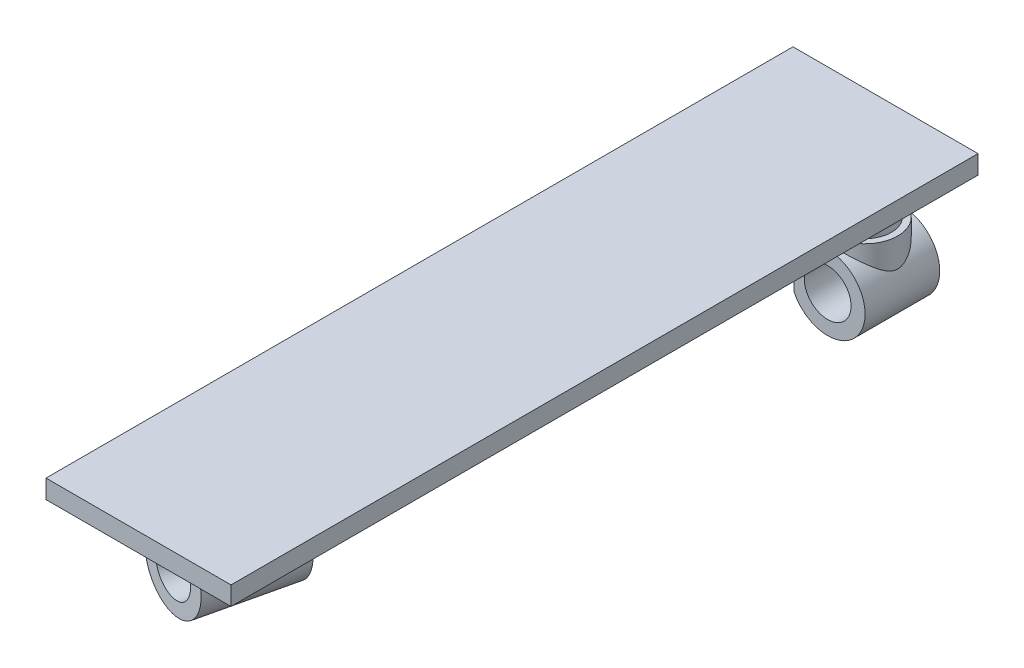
ISO-10303-21;
HEADER;
FILE_DESCRIPTION(('STEP AP214'),'2;1');
FILE_NAME('part.step','',(''),(''),'','','');
FILE_SCHEMA(('AUTOMOTIVE_DESIGN { 1 0 10303 214 1 1 1 1 }'));
ENDSEC;
DATA;
#1=APPLICATION_CONTEXT('core data for automotive mechanical design processes');
#2=APPLICATION_PROTOCOL_DEFINITION('international standard','automotive_design',2000,#1);
#3=PRODUCT_CONTEXT('',#1,'mechanical');
#4=PRODUCT('Part','Part','',(#3));
#5=PRODUCT_RELATED_PRODUCT_CATEGORY('part','',(#4));
#6=PRODUCT_DEFINITION_FORMATION('','',#4);
#7=PRODUCT_DEFINITION_CONTEXT('part definition',#1,'design');
#8=PRODUCT_DEFINITION('design','',#6,#7);
#9=PRODUCT_DEFINITION_SHAPE('','',#8);
#10=(LENGTH_UNIT() NAMED_UNIT(*) SI_UNIT(.MILLI.,.METRE.));
#11=(NAMED_UNIT(*) PLANE_ANGLE_UNIT() SI_UNIT($,.RADIAN.));
#12=(NAMED_UNIT(*) SI_UNIT($,.STERADIAN.) SOLID_ANGLE_UNIT());
#13=UNCERTAINTY_MEASURE_WITH_UNIT(LENGTH_MEASURE(1.E-05),#10,'distance_accuracy_value','');
#14=(GEOMETRIC_REPRESENTATION_CONTEXT(3) GLOBAL_UNCERTAINTY_ASSIGNED_CONTEXT((#13)) GLOBAL_UNIT_ASSIGNED_CONTEXT((#10,
#11,#12)) REPRESENTATION_CONTEXT('',''));
#15=CARTESIAN_POINT('',(0.,0.,0.));
#16=DIRECTION('',(0.,0.,1.));
#17=DIRECTION('',(1.,0.,0.));
#18=AXIS2_PLACEMENT_3D('',#15,#16,#17);
#19=CARTESIAN_POINT('',(-40.5389276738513,0.,300.));
#20=DIRECTION('',(0.,-1.,0.));
#21=DIRECTION('',(0.,0.,-1.));
#22=AXIS2_PLACEMENT_3D('',#19,#20,#21);
#23=PLANE('',#22);
#24=DIRECTION('',(-0.224951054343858,0.,0.974370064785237));
#25=VECTOR('',#24,1.);
#26=CARTESIAN_POINT('',(-20.4860149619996,0.,268.708935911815));
#27=LINE('',#26,#25);
#28=CARTESIAN_POINT('',(-26.8381368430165,0.,296.222998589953));
#29=VERTEX_POINT('',#28);
#30=CARTESIAN_POINT('',(-29.8804668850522,0.,309.400777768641));
#31=VERTEX_POINT('',#30);
#32=EDGE_CURVE('E115',#29,#31,#27,.T.);
#33=ORIENTED_EDGE('',*,*,#32,.F.);
#34=CARTESIAN_POINT('',(-40.5389276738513,0.,300.));
#35=DIRECTION('',(0.,-1.,0.));
#36=DIRECTION('',(0.,0.,-1.));
#37=AXIS2_PLACEMENT_3D('',#34,#35,#36);
#38=CIRCLE('',#37,14.2118756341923);
#39=EDGE_CURVE('E11',#31,#29,#38,.F.);
#40=ORIENTED_EDGE('',*,*,#39,.F.);
#41=EDGE_LOOP('',(#33,#40));
#42=FACE_BOUND('',#41,.T.);
#43=ADVANCED_FACE('F37',(#42),#23,.T.);
#44=CARTESIAN_POINT('',(-40.5389276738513,0.,300.));
#45=DIRECTION('',(0.,1.,0.));
#46=DIRECTION('',(0.,0.,1.));
#47=AXIS2_PLACEMENT_3D('',#44,#45,#46);
#48=CYLINDRICAL_SURFACE('',#47,17.5);
#49=CARTESIAN_POINT('',(-40.5389276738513,19.6087439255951,317.5));
#50=CARTESIAN_POINT('',(-40.0737309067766,19.5177406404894,317.499995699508));
#51=CARTESIAN_POINT('',(-39.6113945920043,19.4117596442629,317.481418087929));
#52=CARTESIAN_POINT('',(-38.6966225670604,19.1725829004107,317.408809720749));
#53=CARTESIAN_POINT('',(-38.24419031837,19.0393778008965,317.354766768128));
#54=CARTESIAN_POINT('',(-37.3520128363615,18.7486748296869,317.213303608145));
#55=CARTESIAN_POINT('',(-36.9122831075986,18.5911486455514,317.125844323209));
#56=CARTESIAN_POINT('',(-36.0482358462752,18.2550234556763,316.919843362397));
#57=CARTESIAN_POINT('',(-35.6239268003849,18.0764130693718,316.801284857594));
#58=CARTESIAN_POINT('',(-34.7969649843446,17.7033123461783,316.536818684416));
#59=CARTESIAN_POINT('',(-34.3941324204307,17.5090071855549,316.391209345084));
#60=CARTESIAN_POINT('',(-33.6065890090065,17.1059622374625,316.073980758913));
#61=CARTESIAN_POINT('',(-33.2218720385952,16.897227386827,315.902370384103));
#62=CARTESIAN_POINT('',(-32.4708873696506,16.4680407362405,315.534849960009));
#63=CARTESIAN_POINT('',(-32.1046257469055,16.24758512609,315.338931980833));
#64=CARTESIAN_POINT('',(-31.3909738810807,15.7977950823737,314.924317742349));
#65=CARTESIAN_POINT('',(-31.0435843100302,15.5684603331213,314.70562067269));
#66=CARTESIAN_POINT('',(-30.3007467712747,15.0575884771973,314.201032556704));
#67=CARTESIAN_POINT('',(-29.9094222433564,14.7747147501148,313.910415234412));
#68=CARTESIAN_POINT('',(-29.1538444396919,14.2051196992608,313.299103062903));
#69=CARTESIAN_POINT('',(-28.7895984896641,13.9183973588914,312.978400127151));
#70=CARTESIAN_POINT('',(-28.088231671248,13.3469004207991,312.307144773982));
#71=CARTESIAN_POINT('',(-27.7511065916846,13.0621255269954,311.956597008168));
#72=CARTESIAN_POINT('',(-27.1041005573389,12.5015428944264,311.224704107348));
#73=CARTESIAN_POINT('',(-26.794207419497,12.2257311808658,310.843372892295));
#74=CARTESIAN_POINT('',(-26.3220418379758,11.8004410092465,310.208681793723));
#75=CARTESIAN_POINT('',(-26.1507709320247,11.6449978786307,309.965967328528));
#76=CARTESIAN_POINT('',(-25.8184216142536,11.3433253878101,309.468171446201));
#77=CARTESIAN_POINT('',(-25.6573409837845,11.1970940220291,309.213092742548));
#78=CARTESIAN_POINT('',(-25.3460122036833,10.9171997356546,308.690100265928));
#79=CARTESIAN_POINT('',(-25.1957540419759,10.7835251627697,308.422198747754));
#80=CARTESIAN_POINT('',(-24.9067356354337,10.5326092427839,307.872791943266));
#81=CARTESIAN_POINT('',(-24.7679728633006,10.4153642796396,307.591289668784));
#82=CARTESIAN_POINT('',(-24.5308474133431,10.2243634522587,307.074907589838));
#83=CARTESIAN_POINT('',(-24.4301057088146,10.1466407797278,306.8425932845));
#84=CARTESIAN_POINT('',(-24.2373553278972,10.0070082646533,306.369762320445));
#85=CARTESIAN_POINT('',(-24.1453437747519,9.94509320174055,306.129248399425));
#86=CARTESIAN_POINT('',(-23.9711069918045,9.83965525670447,305.641299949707));
#87=CARTESIAN_POINT('',(-23.8888615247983,9.79609384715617,305.393881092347));
#88=CARTESIAN_POINT('',(-23.734869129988,9.7292443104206,304.893078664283));
#89=CARTESIAN_POINT('',(-23.6631216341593,9.70595508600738,304.639695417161));
#90=CARTESIAN_POINT('',(-23.530541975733,9.6808073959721,304.127376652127));
#91=CARTESIAN_POINT('',(-23.4697785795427,9.67907962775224,303.868416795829));
#92=CARTESIAN_POINT('',(-23.3602672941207,9.69748949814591,303.348753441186));
#93=CARTESIAN_POINT('',(-23.3115194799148,9.71762727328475,303.088049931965));
#94=CARTESIAN_POINT('',(-23.2261574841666,9.77872582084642,302.566689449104));
#95=CARTESIAN_POINT('',(-23.1895633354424,9.81972069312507,302.306033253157));
#96=CARTESIAN_POINT('',(-23.1284411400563,9.92053623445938,301.786981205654));
#97=CARTESIAN_POINT('',(-23.1039151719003,9.98036014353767,301.528585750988));
#98=CARTESIAN_POINT('',(-23.0597412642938,10.1409523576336,300.922408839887));
#99=CARTESIAN_POINT('',(-23.0450697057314,10.2487033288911,300.576115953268));
#100=CARTESIAN_POINT('',(-23.0359109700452,10.487971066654,299.891605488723));
#101=CARTESIAN_POINT('',(-23.041433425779,10.6194991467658,299.553391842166));
#102=CARTESIAN_POINT('',(-23.0713060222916,10.9009151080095,298.884343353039));
#103=CARTESIAN_POINT('',(-23.0957178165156,11.050861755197,298.553536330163));
#104=CARTESIAN_POINT('',(-23.1622640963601,11.3639423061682,297.900139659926));
#105=CARTESIAN_POINT('',(-23.204398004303,11.5270757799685,297.577549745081));
#106=CARTESIAN_POINT('',(-23.2983258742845,11.8388648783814,296.985319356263));
#107=CARTESIAN_POINT('',(-23.347897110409,11.9862848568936,296.714667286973));
#108=CARTESIAN_POINT('',(-23.4590561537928,12.2861107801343,296.178626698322));
#109=CARTESIAN_POINT('',(-23.5206455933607,12.4385173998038,295.913238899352));
#110=CARTESIAN_POINT('',(-23.7230874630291,12.9008774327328,295.124270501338));
#111=CARTESIAN_POINT('',(-23.8815837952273,13.2158716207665,294.608068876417));
#112=CARTESIAN_POINT('',(-24.2445699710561,13.8489776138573,293.594246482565));
#113=CARTESIAN_POINT('',(-24.4490598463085,14.1670894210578,293.096625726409));
#114=CARTESIAN_POINT('',(-24.9041583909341,14.7986183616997,292.120025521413));
#115=CARTESIAN_POINT('',(-25.1547495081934,15.1120372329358,291.641039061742));
#116=CARTESIAN_POINT('',(-25.6640551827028,15.6839377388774,290.76931116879));
#117=CARTESIAN_POINT('',(-25.9166104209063,15.9439208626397,290.373951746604));
#118=CARTESIAN_POINT('',(-26.4569419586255,16.4514277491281,289.59949110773));
#119=CARTESIAN_POINT('',(-26.7447197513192,16.698950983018,289.220390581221));
#120=CARTESIAN_POINT('',(-27.3554799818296,17.1769566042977,288.481490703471));
#121=CARTESIAN_POINT('',(-27.6784016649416,17.4074672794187,288.121659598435));
#122=CARTESIAN_POINT('',(-28.3600237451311,17.8475900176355,287.423750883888));
#123=CARTESIAN_POINT('',(-28.7187145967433,18.0572076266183,287.085667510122));
#124=CARTESIAN_POINT('',(-29.3890869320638,18.4079974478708,286.506219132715));
#125=CARTESIAN_POINT('',(-29.693891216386,18.5541122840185,286.259873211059));
#126=CARTESIAN_POINT('',(-30.3244639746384,18.8286856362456,285.784850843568));
#127=CARTESIAN_POINT('',(-30.6502277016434,18.9571481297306,285.556170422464));
#128=CARTESIAN_POINT('',(-31.3216342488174,19.1942512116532,285.118737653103));
#129=CARTESIAN_POINT('',(-31.6672709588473,19.3028978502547,284.909979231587));
#130=CARTESIAN_POINT('',(-32.3769552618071,19.4983820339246,284.514614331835));
#131=CARTESIAN_POINT('',(-32.7410030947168,19.5852192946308,284.328008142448));
#132=CARTESIAN_POINT('',(-33.4878815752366,19.7357933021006,283.978016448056));
#133=CARTESIAN_POINT('',(-33.8708232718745,19.7993686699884,283.814797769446));
#134=CARTESIAN_POINT('',(-34.6503649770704,19.9011360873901,283.515183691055));
#135=CARTESIAN_POINT('',(-35.0469650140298,19.939328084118,283.378788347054));
#136=CARTESIAN_POINT('',(-35.8503361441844,19.9894001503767,283.134552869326));
#137=CARTESIAN_POINT('',(-36.2571034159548,20.0012899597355,283.026702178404));
#138=CARTESIAN_POINT('',(-37.077249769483,19.9984884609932,282.840642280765));
#139=CARTESIAN_POINT('',(-37.4906282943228,19.983799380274,282.762430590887));
#140=CARTESIAN_POINT('',(-38.2757315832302,19.9311964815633,282.64291640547));
#141=CARTESIAN_POINT('',(-38.6471767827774,19.8959379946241,282.598558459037));
#142=CARTESIAN_POINT('',(-39.3896475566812,19.805214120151,282.533804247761));
#143=CARTESIAN_POINT('',(-39.7606731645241,19.7497504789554,282.513405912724));
#144=CARTESIAN_POINT('',(-40.4999007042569,19.6196174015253,282.496137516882));
#145=CARTESIAN_POINT('',(-40.8681023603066,19.5449461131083,282.499269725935));
#146=CARTESIAN_POINT('',(-41.5994856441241,19.3776645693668,282.528331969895));
#147=CARTESIAN_POINT('',(-41.9626669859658,19.2850532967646,282.554263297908));
#148=CARTESIAN_POINT('',(-42.6958880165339,19.0794790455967,282.629378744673));
#149=CARTESIAN_POINT('',(-43.0656596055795,18.9658736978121,282.679413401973));
#150=CARTESIAN_POINT('',(-43.7960713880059,18.7226120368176,282.801797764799));
#151=CARTESIAN_POINT('',(-44.1567116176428,18.5929557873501,282.874147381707));
#152=CARTESIAN_POINT('',(-44.8675988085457,18.3193400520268,283.039875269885));
#153=CARTESIAN_POINT('',(-45.217844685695,18.1753790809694,283.13325572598));
#154=CARTESIAN_POINT('',(-45.9069738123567,17.8749040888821,283.339762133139));
#155=CARTESIAN_POINT('',(-46.2458546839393,17.7183874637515,283.452892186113));
#156=CARTESIAN_POINT('',(-47.0767665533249,17.3141173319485,283.758440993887));
#157=CARTESIAN_POINT('',(-47.5613439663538,17.0596319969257,283.962346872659));
#158=CARTESIAN_POINT('',(-48.5020864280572,16.5318670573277,284.408038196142));
#159=CARTESIAN_POINT('',(-48.9582391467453,16.2585794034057,284.649839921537));
#160=CARTESIAN_POINT('',(-49.8428796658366,15.6976579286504,285.16927316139));
#161=CARTESIAN_POINT('',(-50.2712708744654,15.4099796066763,285.447020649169));
#162=CARTESIAN_POINT('',(-51.0985354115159,14.8265540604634,286.035673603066));
#163=CARTESIAN_POINT('',(-51.4974141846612,14.5308083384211,286.346572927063));
#164=CARTESIAN_POINT('',(-52.2741982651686,13.9305235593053,287.007723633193));
#165=CARTESIAN_POINT('',(-52.6514603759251,13.6259329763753,287.358682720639));
#166=CARTESIAN_POINT('',(-53.3757164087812,13.0212710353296,288.09480306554));
#167=CARTESIAN_POINT('',(-53.7226947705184,12.7212020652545,288.479981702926));
#168=CARTESIAN_POINT('',(-54.21939815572,12.2822952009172,289.083853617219));
#169=CARTESIAN_POINT('',(-54.3807756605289,12.1380718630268,289.289159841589));
#170=CARTESIAN_POINT('',(-54.6957238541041,11.8547004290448,289.709032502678));
#171=CARTESIAN_POINT('',(-54.8492957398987,11.7155515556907,289.923597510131));
#172=CARTESIAN_POINT('',(-55.1483019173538,11.4442331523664,290.362232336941));
#173=CARTESIAN_POINT('',(-55.2937437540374,11.3120571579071,290.586292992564));
#174=CARTESIAN_POINT('',(-55.576290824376,11.0567460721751,291.044546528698));
#175=CARTESIAN_POINT('',(-55.713398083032,10.9336087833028,291.27873692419));
#176=CARTESIAN_POINT('',(-55.9700796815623,10.7066927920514,291.741975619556));
#177=CARTESIAN_POINT('',(-56.0902140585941,10.6021734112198,291.970348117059));
#178=CARTESIAN_POINT('',(-56.3222206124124,10.4058219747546,292.436572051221));
#179=CARTESIAN_POINT('',(-56.4340936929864,10.3139885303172,292.6744224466));
#180=CARTESIAN_POINT('',(-56.6485949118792,10.1460167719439,293.159044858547));
#181=CARTESIAN_POINT('',(-56.7512422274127,10.0698454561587,293.405796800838));
#182=CARTESIAN_POINT('',(-56.9465767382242,9.93594032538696,293.908070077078));
#183=CARTESIAN_POINT('',(-57.0392669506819,9.87820091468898,294.163588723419));
#184=CARTESIAN_POINT('',(-57.2148636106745,9.78322623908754,294.685860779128));
#185=CARTESIAN_POINT('',(-57.297615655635,9.74628803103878,294.952721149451));
#186=CARTESIAN_POINT('',(-57.4507046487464,9.69628533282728,295.492186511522));
#187=CARTESIAN_POINT('',(-57.5210430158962,9.6832181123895,295.76479084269));
#188=CARTESIAN_POINT('',(-57.6484665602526,9.68176334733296,296.313144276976));
#189=CARTESIAN_POINT('',(-57.7055519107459,9.69337548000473,296.588893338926));
#190=CARTESIAN_POINT('',(-57.8060597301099,9.7405534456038,297.14082536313));
#191=CARTESIAN_POINT('',(-57.8494802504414,9.77612269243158,297.417008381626));
#192=CARTESIAN_POINT('',(-57.9263781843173,9.87384840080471,297.99503365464));
#193=CARTESIAN_POINT('',(-57.9584221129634,9.93831308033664,298.296672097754));
#194=CARTESIAN_POINT('',(-58.0066174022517,10.0899706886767,298.895413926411));
#195=CARTESIAN_POINT('',(-58.0227655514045,10.177168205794,299.192516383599));
#196=CARTESIAN_POINT('',(-58.0400598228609,10.370457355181,299.781874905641));
#197=CARTESIAN_POINT('',(-58.0411596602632,10.4766062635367,300.074113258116));
#198=CARTESIAN_POINT('',(-58.0291521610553,10.7037965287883,300.652515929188));
#199=CARTESIAN_POINT('',(-58.0160387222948,10.8248442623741,300.938677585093));
#200=CARTESIAN_POINT('',(-57.9790619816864,11.0615169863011,301.467026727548));
#201=CARTESIAN_POINT('',(-57.9568684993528,11.1757066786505,301.709982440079));
#202=CARTESIAN_POINT('',(-57.9028678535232,11.410898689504,302.191396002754));
#203=CARTESIAN_POINT('',(-57.8710626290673,11.5318996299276,302.429854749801));
#204=CARTESIAN_POINT('',(-57.7617123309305,11.9029770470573,303.139263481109));
#205=CARTESIAN_POINT('',(-57.6702529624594,12.1609997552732,303.603968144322));
#206=CARTESIAN_POINT('',(-57.4519898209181,12.6888676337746,304.518819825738));
#207=CARTESIAN_POINT('',(-57.3251350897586,12.9587293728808,304.968944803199));
#208=CARTESIAN_POINT('',(-57.036973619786,13.5029614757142,305.855032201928));
#209=CARTESIAN_POINT('',(-56.875675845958,13.7773306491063,306.290998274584));
#210=CARTESIAN_POINT('',(-56.5041729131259,14.3475144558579,307.184262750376));
#211=CARTESIAN_POINT('',(-56.2910515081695,14.6432527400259,307.640400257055));
#212=CARTESIAN_POINT('',(-55.8241765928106,15.2278546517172,308.536172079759));
#213=CARTESIAN_POINT('',(-55.5704160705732,15.51671708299,308.975803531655));
#214=CARTESIAN_POINT('',(-55.0220525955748,16.0816335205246,309.836096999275));
#215=CARTESIAN_POINT('',(-54.7275245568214,16.3577098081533,310.256791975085));
#216=CARTESIAN_POINT('',(-54.0965619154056,16.8922880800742,311.077374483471));
#217=CARTESIAN_POINT('',(-53.7601403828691,17.1507955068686,311.477268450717));
#218=CARTESIAN_POINT('',(-53.1279586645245,17.5874947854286,312.162661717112));
#219=CARTESIAN_POINT('',(-52.840874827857,17.7704051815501,312.453175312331));
#220=CARTESIAN_POINT('',(-52.2418227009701,18.1200987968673,313.017740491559));
#221=CARTESIAN_POINT('',(-51.9298602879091,18.2868858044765,313.291795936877));
#222=CARTESIAN_POINT('',(-51.2814729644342,18.6017043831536,313.821100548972));
#223=CARTESIAN_POINT('',(-50.9450509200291,18.7497381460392,314.076351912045));
#224=CARTESIAN_POINT('',(-50.2486475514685,19.024409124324,314.565450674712));
#225=CARTESIAN_POINT('',(-49.8886660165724,19.1510461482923,314.7992978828));
#226=CARTESIAN_POINT('',(-49.1431810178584,19.3814353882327,315.244906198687));
#227=CARTESIAN_POINT('',(-48.7574660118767,19.4849566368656,315.456434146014));
#228=CARTESIAN_POINT('',(-47.9660585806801,19.6651401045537,315.851919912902));
#229=CARTESIAN_POINT('',(-47.5603656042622,19.7418015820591,316.0358769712));
#230=CARTESIAN_POINT('',(-46.7327428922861,19.8662270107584,316.373335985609));
#231=CARTESIAN_POINT('',(-46.3108322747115,19.9140239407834,316.526872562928));
#232=CARTESIAN_POINT('',(-45.4543533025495,19.9795345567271,316.80150832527));
#233=CARTESIAN_POINT('',(-45.0197881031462,19.9972556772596,316.922615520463));
#234=CARTESIAN_POINT('',(-44.2484173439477,20.0015648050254,317.10575361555));
#235=CARTESIAN_POINT('',(-43.9133229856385,19.9946329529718,317.174988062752));
#236=CARTESIAN_POINT('',(-43.2403466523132,19.9633162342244,317.29361331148));
#237=CARTESIAN_POINT('',(-42.9024640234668,19.9389271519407,317.342999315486));
#238=CARTESIAN_POINT('',(-42.2260391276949,19.8730760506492,317.421814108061));
#239=CARTESIAN_POINT('',(-41.8874968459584,19.8316136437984,317.451242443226));
#240=CARTESIAN_POINT('',(-41.2117826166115,19.7322797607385,317.490335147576));
#241=CARTESIAN_POINT('',(-40.8746104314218,19.6744112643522,317.500003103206));
#242=CARTESIAN_POINT('',(-40.5389276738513,19.6087439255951,317.5));
#243=B_SPLINE_CURVE_WITH_KNOTS('',3,(#49,#50,#51,#52,#53,#54,#55,#56,#57,#58,#59,#60,#61,#62,
#63,#64,#65,#66,#67,#68,#69,#70,#71,#72,#73,#74,#75,#76,#77,#78,#79,#80,#81,#82,#83,#84,#85,#86,
#87,#88,#89,#90,#91,#92,#93,#94,#95,#96,#97,#98,#99,#100,#101,#102,#103,#104,#105,#106,#107,
#108,#109,#110,#111,#112,#113,#114,#115,#116,#117,#118,#119,#120,#121,#122,#123,#124,#125,#126,
#127,#128,#129,#130,#131,#132,#133,#134,#135,#136,#137,#138,#139,#140,#141,#142,#143,#144,#145,
#146,#147,#148,#149,#150,#151,#152,#153,#154,#155,#156,#157,#158,#159,#160,#161,#162,#163,#164,
#165,#166,#167,#168,#169,#170,#171,#172,#173,#174,#175,#176,#177,#178,#179,#180,#181,#182,#183,
#184,#185,#186,#187,#188,#189,#190,#191,#192,#193,#194,#195,#196,#197,#198,#199,#200,#201,#202,
#203,#204,#205,#206,#207,#208,#209,#210,#211,#212,#213,#214,#215,#216,#217,#218,#219,#220,#221,
#222,#223,#224,#225,#226,#227,#228,#229,#230,#231,#232,#233,#234,#235,#236,#237,#238,#239,#240,
#241,#242),.UNSPECIFIED.,.T.,.F.,(4,2,2,2,2,2,2,2,2,2,2,2,2,2,2,2,2,2,2,2,2,2,2,2,2,2,2,2,2,2,2,
2,2,2,2,2,2,2,2,2,2,2,2,2,2,2,2,2,2,2,2,2,2,2,2,2,2,2,2,2,2,2,2,2,2,2,2,2,2,2,2,2,2,2,2,2,2,2,2,
2,2,2,2,2,2,2,2,2,2,2,2,2,2,2,2,2,4),(0.,1.42161879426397,2.84372675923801,4.2675028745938,
5.69205104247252,7.10173258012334,8.51093418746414,9.92059673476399,11.3303094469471,
13.0194590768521,14.7090640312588,16.3984061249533,18.0869885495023,19.0923868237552,
20.0975654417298,21.1018018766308,22.1058169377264,22.8998051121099,23.6935307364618,
24.4855817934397,25.277589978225,26.0743967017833,26.8712084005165,27.6693270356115,
28.4675830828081,29.5546862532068,30.6423080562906,31.7334948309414,32.8246460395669,
33.7607826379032,34.6970464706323,36.5702056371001,38.4433660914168,40.3158148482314,
41.9234909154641,43.5312351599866,45.1362429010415,46.7408234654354,47.9944519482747,
49.2477975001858,50.5007597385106,51.7537383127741,53.0152515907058,54.2767674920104,
55.5378161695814,56.7987591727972,57.9246804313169,59.0505043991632,60.1764369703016,
61.3024334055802,62.4714493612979,63.6404606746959,64.8095934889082,65.978969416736,
67.7286491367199,69.4790826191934,71.2353113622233,72.9912152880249,74.7852335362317,
76.5801682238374,77.4748928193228,78.3694797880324,79.263222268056,80.1567467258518,
80.9914705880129,81.8261029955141,82.6589582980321,83.4915605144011,84.3357695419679,
85.1798820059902,86.0239834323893,86.8682051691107,87.7970741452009,88.7261307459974,
89.658044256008,90.5903580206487,91.3981423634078,92.2057638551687,93.8219237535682,
95.4404225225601,97.0585005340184,98.8085717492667,100.558945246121,102.306143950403,
104.052798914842,105.394196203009,106.735277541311,108.076201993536,109.417138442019,
110.770926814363,112.124752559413,113.477028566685,114.828970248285,115.854715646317,
116.880708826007,117.906725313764,118.932555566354),.UNSPECIFIED.);
#244=CARTESIAN_POINT('',(-40.5389276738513,19.6087439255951,317.5));
#245=VERTEX_POINT('',#244);
#246=EDGE_CURVE('E41',#245,#245,#243,.T.);
#247=ORIENTED_EDGE('',*,*,#246,.T.);
#248=EDGE_LOOP('',(#247));
#249=FACE_BOUND('',#248,.T.);
#250=CARTESIAN_POINT('',(-40.5389276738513,25.,300.));
#251=DIRECTION('',(0.,-1.,0.));
#252=DIRECTION('',(0.,0.,-1.));
#253=AXIS2_PLACEMENT_3D('',#250,#251,#252);
#254=CIRCLE('',#253,17.5);
#255=CARTESIAN_POINT('',(-40.5389276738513,25.,282.5));
#256=VERTEX_POINT('',#255);
#257=EDGE_CURVE('E133',#256,#256,#254,.T.);
#258=ORIENTED_EDGE('',*,*,#257,.T.);
#259=EDGE_LOOP('',(#258));
#260=FACE_BOUND('',#259,.T.);
#261=ADVANCED_FACE('F225',(#249,#260),#48,.T.);
#262=CARTESIAN_POINT('',(30.7914319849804,45.,370.31319337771));
#263=DIRECTION('',(0.,-1.,0.));
#264=DIRECTION('',(0.,0.,-1.));
#265=AXIS2_PLACEMENT_3D('',#262,#263,#264);
#266=PLANE('',#265);
#267=DIRECTION('',(0.,0.,-1.));
#268=VECTOR('',#267,1.);
#269=CARTESIAN_POINT('',(30.7914319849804,45.,-29.6868066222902));
#270=LINE('',#269,#268);
#271=CARTESIAN_POINT('',(30.7914319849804,45.,370.31319337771));
#272=VERTEX_POINT('',#271);
#273=CARTESIAN_POINT('',(30.7914319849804,45.,-29.6868066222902));
#274=VERTEX_POINT('',#273);
#275=EDGE_CURVE('E143',#272,#274,#270,.T.);
#276=ORIENTED_EDGE('',*,*,#275,.F.);
#277=DIRECTION('',(1.,0.,0.));
#278=VECTOR('',#277,1.);
#279=CARTESIAN_POINT('',(30.7914319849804,45.,370.31319337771));
#280=LINE('',#279,#278);
#281=CARTESIAN_POINT('',(-68.2784755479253,45.,370.31319337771));
#282=VERTEX_POINT('',#281);
#283=EDGE_CURVE('E153',#282,#272,#280,.T.);
#284=ORIENTED_EDGE('',*,*,#283,.F.);
#285=DIRECTION('',(0.,0.,1.));
#286=VECTOR('',#285,1.);
#287=CARTESIAN_POINT('',(-68.2784755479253,45.,-29.6868066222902));
#288=LINE('',#287,#286);
#289=CARTESIAN_POINT('',(-68.2784755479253,45.,-29.6868066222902));
#290=VERTEX_POINT('',#289);
#291=EDGE_CURVE('E150',#290,#282,#288,.T.);
#292=ORIENTED_EDGE('',*,*,#291,.F.);
#293=DIRECTION('',(-1.,0.,0.));
#294=VECTOR('',#293,1.);
#295=CARTESIAN_POINT('',(30.7914319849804,45.,-29.6868066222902));
#296=LINE('',#295,#294);
#297=EDGE_CURVE('E146',#274,#290,#296,.T.);
#298=ORIENTED_EDGE('',*,*,#297,.F.);
#299=EDGE_LOOP('',(#276,#284,#292,#298));
#300=FACE_BOUND('',#299,.T.);
#301=CARTESIAN_POINT('',(0.,45.,0.));
#302=DIRECTION('',(0.,-1.,0.));
#303=DIRECTION('',(0.,0.,-1.));
#304=AXIS2_PLACEMENT_3D('',#301,#302,#303);
#305=CIRCLE('',#304,14.142135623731);
#306=CARTESIAN_POINT('',(0.,45.,-14.142135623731));
#307=VERTEX_POINT('',#306);
#308=EDGE_CURVE('E119',#307,#307,#305,.F.);
#309=ORIENTED_EDGE('',*,*,#308,.T.);
#310=EDGE_LOOP('',(#309));
#311=FACE_BOUND('',#310,.T.);
#312=CARTESIAN_POINT('',(-40.5389276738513,45.,300.));
#313=DIRECTION('',(0.,-1.,0.));
#314=DIRECTION('',(0.,0.,-1.));
#315=AXIS2_PLACEMENT_3D('',#312,#313,#314);
#316=CIRCLE('',#315,12.5);
#317=CARTESIAN_POINT('',(-40.5389276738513,45.,287.5));
#318=VERTEX_POINT('',#317);
#319=EDGE_CURVE('E136',#318,#318,#316,.T.);
#320=ORIENTED_EDGE('',*,*,#319,.F.);
#321=EDGE_LOOP('',(#320));
#322=FACE_BOUND('',#321,.T.);
#323=ADVANCED_FACE('F221',(#300,#311,#322),#266,.T.);
#324=CARTESIAN_POINT('',(0.,0.,20.));
#325=DIRECTION('',(0.,0.,1.));
#326=DIRECTION('',(1.,0.,0.));
#327=AXIS2_PLACEMENT_3D('',#324,#325,#326);
#328=PLANE('',#327);
#329=DIRECTION('',(0.,1.,0.));
#330=VECTOR('',#329,1.);
#331=CARTESIAN_POINT('',(-18.,10.,20.));
#332=LINE('',#331,#330);
#333=CARTESIAN_POINT('',(-18.,-8.71779788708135,20.));
#334=VERTEX_POINT('',#333);
#335=CARTESIAN_POINT('',(-18.,8.71779788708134,20.));
#336=VERTEX_POINT('',#335);
#337=EDGE_CURVE('E57',#334,#336,#332,.T.);
#338=ORIENTED_EDGE('',*,*,#337,.F.);
#339=CARTESIAN_POINT('',(0.,0.,20.));
#340=DIRECTION('',(0.,0.,1.));
#341=DIRECTION('',(1.,0.,0.));
#342=AXIS2_PLACEMENT_3D('',#339,#340,#341);
#343=CIRCLE('',#342,20.);
#344=EDGE_CURVE('E478',#334,#336,#343,.T.);
#345=ORIENTED_EDGE('',*,*,#344,.T.);
#346=EDGE_LOOP('',(#338,#345));
#347=FACE_BOUND('',#346,.T.);
#348=CARTESIAN_POINT('',(0.,0.,20.));
#349=DIRECTION('',(0.,0.,1.));
#350=DIRECTION('',(1.,0.,0.));
#351=AXIS2_PLACEMENT_3D('',#348,#349,#350);
#352=CIRCLE('',#351,12.5);
#353=CARTESIAN_POINT('',(12.5,0.,20.));
#354=VERTEX_POINT('',#353);
#355=EDGE_CURVE('E188',#354,#354,#352,.T.);
#356=ORIENTED_EDGE('',*,*,#355,.F.);
#357=EDGE_LOOP('',(#356));
#358=FACE_BOUND('',#357,.T.);
#359=ADVANCED_FACE('F224',(#347,#358),#328,.T.);
#360=CARTESIAN_POINT('',(0.,0.,-20.));
#361=DIRECTION('',(0.,0.,1.));
#362=DIRECTION('',(1.,0.,0.));
#363=AXIS2_PLACEMENT_3D('',#360,#361,#362);
#364=PLANE('',#363);
#365=CARTESIAN_POINT('',(0.,0.,-20.));
#366=DIRECTION('',(0.,0.,1.));
#367=DIRECTION('',(1.,0.,0.));
#368=AXIS2_PLACEMENT_3D('',#365,#366,#367);
#369=CIRCLE('',#368,20.);
#370=CARTESIAN_POINT('',(-18.,-8.71779788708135,-20.));
#371=VERTEX_POINT('',#370);
#372=CARTESIAN_POINT('',(-18.,8.71779788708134,-20.));
#373=VERTEX_POINT('',#372);
#374=EDGE_CURVE('E479',#371,#373,#369,.T.);
#375=ORIENTED_EDGE('',*,*,#374,.F.);
#376=DIRECTION('',(0.,1.,0.));
#377=VECTOR('',#376,1.);
#378=CARTESIAN_POINT('',(-18.,10.,-20.));
#379=LINE('',#378,#377);
#380=EDGE_CURVE('E174',#371,#373,#379,.T.);
#381=ORIENTED_EDGE('',*,*,#380,.T.);
#382=EDGE_LOOP('',(#375,#381));
#383=FACE_BOUND('',#382,.T.);
#384=CARTESIAN_POINT('',(0.,0.,-20.));
#385=DIRECTION('',(0.,0.,1.));
#386=DIRECTION('',(1.,0.,0.));
#387=AXIS2_PLACEMENT_3D('',#384,#385,#386);
#388=CIRCLE('',#387,12.5);
#389=CARTESIAN_POINT('',(12.5,0.,-20.));
#390=VERTEX_POINT('',#389);
#391=EDGE_CURVE('E187',#390,#390,#388,.T.);
#392=ORIENTED_EDGE('',*,*,#391,.T.);
#393=EDGE_LOOP('',(#392));
#394=FACE_BOUND('',#393,.T.);
#395=ADVANCED_FACE('F302',(#383,#394),#364,.F.);
#396=CARTESIAN_POINT('',(0.,0.,20.));
#397=DIRECTION('',(0.,0.,-1.));
#398=DIRECTION('',(-1.,0.,0.));
#399=AXIS2_PLACEMENT_3D('',#396,#397,#398);
#400=CYLINDRICAL_SURFACE('',#399,20.);
#401=CARTESIAN_POINT('',(0.,20.,17.5));
#402=CARTESIAN_POINT('',(0.409310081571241,20.0000043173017,17.5000043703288));
#403=CARTESIAN_POINT('',(0.81857181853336,19.9874130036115,17.4856188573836));
#404=CARTESIAN_POINT('',(1.63371360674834,19.9373449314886,17.428365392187));
#405=CARTESIAN_POINT('',(2.03959248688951,19.8998598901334,17.3854879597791));
#406=CARTESIAN_POINT('',(2.84495519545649,19.8007848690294,17.271995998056));
#407=CARTESIAN_POINT('',(3.24443051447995,19.739165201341,17.2013473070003));
#408=CARTESIAN_POINT('',(4.03348452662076,19.5931618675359,17.0336049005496));
#409=CARTESIAN_POINT('',(4.42306380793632,19.5087795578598,16.9365127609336));
#410=CARTESIAN_POINT('',(5.18734779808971,19.3195605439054,16.7182045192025));
#411=CARTESIAN_POINT('',(5.5621332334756,19.2148614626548,16.5971506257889));
#412=CARTESIAN_POINT('',(6.29757814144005,18.9865422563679,16.3322776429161));
#413=CARTESIAN_POINT('',(6.6582377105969,18.8629222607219,16.188458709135));
#414=CARTESIAN_POINT('',(7.36399894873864,18.5987498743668,15.8798571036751));
#415=CARTESIAN_POINT('',(7.70910095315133,18.4581978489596,15.715074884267));
#416=CARTESIAN_POINT('',(8.38281370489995,18.1621555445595,15.3662745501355));
#417=CARTESIAN_POINT('',(8.71142079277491,18.0066619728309,15.1822521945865));
#418=CARTESIAN_POINT('',(9.47545139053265,17.6199703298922,14.721904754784));
#419=CARTESIAN_POINT('',(9.90295999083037,17.3827741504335,14.4374321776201));
#420=CARTESIAN_POINT('',(10.7241338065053,16.8885404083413,13.8384055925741));
#421=CARTESIAN_POINT('',(11.1177867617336,16.6314957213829,13.5238407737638));
#422=CARTESIAN_POINT('',(11.8718925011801,16.101891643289,12.8669653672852));
#423=CARTESIAN_POINT('',(12.2322661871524,15.8292976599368,12.5245921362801));
#424=CARTESIAN_POINT('',(12.9189520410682,15.2740176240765,11.8150097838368));
#425=CARTESIAN_POINT('',(13.245268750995,14.9913329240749,11.4478039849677));
#426=CARTESIAN_POINT('',(13.8709259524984,14.4146539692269,10.6816356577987));
#427=CARTESIAN_POINT('',(14.1695316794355,14.1205473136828,10.2821585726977));
#428=CARTESIAN_POINT('',(14.7319137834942,13.532778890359,9.45882545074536));
#429=CARTESIAN_POINT('',(14.9956791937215,13.2391172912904,9.03496179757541));
#430=CARTESIAN_POINT('',(15.4875688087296,12.6601412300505,8.16304947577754));
#431=CARTESIAN_POINT('',(15.7157616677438,12.3748115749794,7.7150496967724));
#432=CARTESIAN_POINT('',(16.1360267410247,11.8215430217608,6.79231309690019));
#433=CARTESIAN_POINT('',(16.3281264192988,11.5535910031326,6.31759696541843));
#434=CARTESIAN_POINT('',(16.5900333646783,11.171205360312,5.5760316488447));
#435=CARTESIAN_POINT('',(16.6739706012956,11.0453363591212,5.32001317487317));
#436=CARTESIAN_POINT('',(16.8311299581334,10.8043372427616,4.79968230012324));
#437=CARTESIAN_POINT('',(16.9043516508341,10.6892075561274,4.53536956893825));
#438=CARTESIAN_POINT('',(17.03927411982,10.4727930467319,3.99869568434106));
#439=CARTESIAN_POINT('',(17.1009917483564,10.37148803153,3.72634699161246));
#440=CARTESIAN_POINT('',(17.2121601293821,10.1859341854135,3.17347969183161));
#441=CARTESIAN_POINT('',(17.2616155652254,10.1016788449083,2.89296424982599));
#442=CARTESIAN_POINT('',(17.3407113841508,9.96518782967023,2.36830260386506));
#443=CARTESIAN_POINT('',(17.3722302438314,9.91001953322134,2.1252065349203));
#444=CARTESIAN_POINT('',(17.425218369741,9.81655062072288,1.63478947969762));
#445=CARTESIAN_POINT('',(17.4466926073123,9.77824166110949,1.3874706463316));
#446=CARTESIAN_POINT('',(17.4791148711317,9.7201678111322,0.890241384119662));
#447=CARTESIAN_POINT('',(17.4900749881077,9.70038162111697,0.64033426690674));
#448=CARTESIAN_POINT('',(17.5012364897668,9.68023037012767,0.139486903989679));
#449=CARTESIAN_POINT('',(17.5014379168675,9.67986523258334,-0.11145333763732));
#450=CARTESIAN_POINT('',(17.4910766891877,9.69857437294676,-0.612370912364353));
#451=CARTESIAN_POINT('',(17.4805141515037,9.71764843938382,-0.862348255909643));
#452=CARTESIAN_POINT('',(17.448891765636,9.77431406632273,-1.35949833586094));
#453=CARTESIAN_POINT('',(17.427831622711,9.81190614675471,-1.60667099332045));
#454=CARTESIAN_POINT('',(17.3756436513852,9.90402925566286,-2.09712557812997));
#455=CARTESIAN_POINT('',(17.344500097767,9.95858673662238,-2.34040080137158));
#456=CARTESIAN_POINT('',(17.2727255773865,10.0825630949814,-2.82173892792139));
#457=CARTESIAN_POINT('',(17.2320912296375,10.1519872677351,-3.05979994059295));
#458=CARTESIAN_POINT('',(17.1147438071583,10.3491760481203,-3.6718974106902));
#459=CARTESIAN_POINT('',(17.0310468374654,10.4868834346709,-4.04140613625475));
#460=CARTESIAN_POINT('',(16.8429306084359,10.786425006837,-4.76504901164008));
#461=CARTESIAN_POINT('',(16.7384974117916,10.9482754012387,-5.11917262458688));
#462=CARTESIAN_POINT('',(16.5101165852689,11.2897476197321,-5.81378986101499));
#463=CARTESIAN_POINT('',(16.3861020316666,11.4694295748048,-6.1542315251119));
#464=CARTESIAN_POINT('',(16.1198996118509,11.8406510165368,-6.82112423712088));
#465=CARTESIAN_POINT('',(15.9777136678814,12.0321892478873,-7.14757675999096));
#466=CARTESIAN_POINT('',(15.7054064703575,12.3846537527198,-7.7247037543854));
#467=CARTESIAN_POINT('',(15.578385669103,12.5442188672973,-7.97768623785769));
#468=CARTESIAN_POINT('',(15.3131866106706,12.8666205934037,-8.47560407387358));
#469=CARTESIAN_POINT('',(15.1750072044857,13.0294575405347,-8.7205385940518));
#470=CARTESIAN_POINT('',(14.7437691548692,13.5207600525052,-9.44387555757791));
#471=CARTESIAN_POINT('',(14.4340769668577,13.8519299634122,-9.9106715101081));
#472=CARTESIAN_POINT('',(13.7709397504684,14.5113743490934,-10.8131561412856));
#473=CARTESIAN_POINT('',(13.4175392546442,14.8396514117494,-11.2488757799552));
#474=CARTESIAN_POINT('',(12.66635234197,15.4857603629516,-12.0884462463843));
#475=CARTESIAN_POINT('',(12.2685859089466,15.8035968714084,-12.4923112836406));
#476=CARTESIAN_POINT('',(11.5236983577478,16.3513589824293,-13.1775945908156));
#477=CARTESIAN_POINT('',(11.1855959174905,16.5848544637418,-13.4659887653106));
#478=CARTESIAN_POINT('',(10.4825372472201,17.0379355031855,-14.0202260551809));
#479=CARTESIAN_POINT('',(10.1175816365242,17.2575213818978,-14.2860696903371));
#480=CARTESIAN_POINT('',(9.36167408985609,17.6789723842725,-14.7924205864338));
#481=CARTESIAN_POINT('',(8.97075936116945,17.8808619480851,-15.0329628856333));
#482=CARTESIAN_POINT('',(8.16333251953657,18.2636105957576,-15.486258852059));
#483=CARTESIAN_POINT('',(7.74682568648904,18.4444739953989,-15.6990182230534));
#484=CARTESIAN_POINT('',(6.97073127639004,18.749625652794,-16.056318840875));
#485=CARTESIAN_POINT('',(6.61524010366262,18.8781487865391,-16.206156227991));
#486=CARTESIAN_POINT('',(5.88978506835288,19.1169080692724,-16.4836639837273));
#487=CARTESIAN_POINT('',(5.51982420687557,19.2271479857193,-16.6113389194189));
#488=CARTESIAN_POINT('',(4.7672696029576,19.4274209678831,-16.8427445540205));
#489=CARTESIAN_POINT('',(4.38468018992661,19.5174608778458,-16.9464833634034));
#490=CARTESIAN_POINT('',(3.60900842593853,19.6756627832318,-17.1284479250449));
#491=CARTESIAN_POINT('',(3.21592595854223,19.7438245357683,-17.20667339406));
#492=CARTESIAN_POINT('',(2.41987100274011,19.8571577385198,-17.3366008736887));
#493=CARTESIAN_POINT('',(2.016856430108,19.9022024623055,-17.3881566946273));
#494=CARTESIAN_POINT('',(1.20621871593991,19.9677334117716,-17.4631242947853));
#495=CARTESIAN_POINT('',(0.798595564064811,19.988219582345,-17.4865360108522));
#496=CARTESIAN_POINT('',(-0.0177076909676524,20.0041573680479,-17.5047516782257));
#497=CARTESIAN_POINT('',(-0.426387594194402,19.9996134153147,-17.4995606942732));
#498=CARTESIAN_POINT('',(-1.24132609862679,19.9656056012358,-17.4606843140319));
#499=CARTESIAN_POINT('',(-1.64758483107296,19.9361431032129,-17.4270004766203));
#500=CARTESIAN_POINT('',(-2.41934317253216,19.8565863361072,-17.3359298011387));
#501=CARTESIAN_POINT('',(-2.7853269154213,19.8084987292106,-17.2808471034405));
#502=CARTESIAN_POINT('',(-3.51008378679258,19.6929924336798,-17.1483237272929));
#503=CARTESIAN_POINT('',(-3.8688574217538,19.6255751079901,-17.070884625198));
#504=CARTESIAN_POINT('',(-4.57722430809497,19.4725540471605,-16.8947406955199));
#505=CARTESIAN_POINT('',(-4.92681597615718,19.3869471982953,-16.7960322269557));
#506=CARTESIAN_POINT('',(-5.61507990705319,19.1989107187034,-16.5786352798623));
#507=CARTESIAN_POINT('',(-5.95375149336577,19.0964800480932,-16.4599455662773));
#508=CARTESIAN_POINT('',(-6.64099831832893,18.8689360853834,-16.1954191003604));
#509=CARTESIAN_POINT('',(-6.98872904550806,18.7427659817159,-16.0483002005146));
#510=CARTESIAN_POINT('',(-7.66901492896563,18.4748446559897,-15.7345653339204));
#511=CARTESIAN_POINT('',(-8.00156984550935,18.3330931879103,-15.5679490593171));
#512=CARTESIAN_POINT('',(-8.65064537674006,18.0359008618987,-15.2168479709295));
#513=CARTESIAN_POINT('',(-8.96716818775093,17.8804618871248,-15.032365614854));
#514=CARTESIAN_POINT('',(-9.58375657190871,17.5576982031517,-14.6469738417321));
#515=CARTESIAN_POINT('',(-9.88381872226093,17.3903710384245,-14.4460610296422));
#516=CARTESIAN_POINT('',(-10.6172602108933,16.9569151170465,-13.9218746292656));
#517=CARTESIAN_POINT('',(-11.0398316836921,16.6842336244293,-13.588815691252));
#518=CARTESIAN_POINT('',(-11.8463443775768,16.1216034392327,-12.8917988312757));
#519=CARTESIAN_POINT('',(-12.2302679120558,15.8316469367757,-12.5278269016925));
#520=CARTESIAN_POINT('',(-12.9614454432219,15.2388790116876,-11.7698599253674));
#521=CARTESIAN_POINT('',(-13.3085076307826,14.936010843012,-11.3757246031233));
#522=CARTESIAN_POINT('',(-13.9640591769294,14.3250058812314,-10.5607085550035));
#523=CARTESIAN_POINT('',(-14.27255791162,14.0168703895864,-10.1398343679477));
#524=CARTESIAN_POINT('',(-14.8580392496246,13.3949589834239,-9.26141456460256));
#525=CARTESIAN_POINT('',(-15.134130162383,13.0812170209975,-8.80324677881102));
#526=CARTESIAN_POINT('',(-15.5179948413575,12.6187236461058,-8.09407620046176));
#527=CARTESIAN_POINT('',(-15.6409672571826,12.4658257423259,-7.85388652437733));
#528=CARTESIAN_POINT('',(-15.876607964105,12.1642869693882,-7.36591807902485));
#529=CARTESIAN_POINT('',(-15.989277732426,12.0156454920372,-7.11814040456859));
#530=CARTESIAN_POINT('',(-16.2033681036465,11.7253223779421,-6.61625282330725));
#531=CARTESIAN_POINT('',(-16.3048577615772,11.5836014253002,-6.3621952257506));
#532=CARTESIAN_POINT('',(-16.4970763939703,11.3081681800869,-5.84571678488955));
#533=CARTESIAN_POINT('',(-16.5878039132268,11.1744569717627,-5.58329481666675));
#534=CARTESIAN_POINT('',(-16.7577981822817,10.9178679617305,-5.05018162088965));
#535=CARTESIAN_POINT('',(-16.8370854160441,10.7949709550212,-4.77950625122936));
#536=CARTESIAN_POINT('',(-16.9836515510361,10.5628789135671,-4.22925343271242));
#537=CARTESIAN_POINT('',(-17.050935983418,10.4536775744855,-3.94968015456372));
#538=CARTESIAN_POINT('',(-17.1642334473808,10.266419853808,-3.42078724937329));
#539=CARTESIAN_POINT('',(-17.2119003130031,10.1861451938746,-3.17261240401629));
#540=CARTESIAN_POINT('',(-17.2969865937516,10.0409832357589,-2.67005175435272));
#541=CARTESIAN_POINT('',(-17.3344071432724,9.97609423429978,-2.41566664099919));
#542=CARTESIAN_POINT('',(-17.3982168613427,9.8643903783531,-1.90229936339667));
#543=CARTESIAN_POINT('',(-17.4246365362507,9.81752556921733,-1.64333201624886));
#544=CARTESIAN_POINT('',(-17.465978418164,9.74378798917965,-1.12162514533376));
#545=CARTESIAN_POINT('',(-17.4809010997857,9.71691439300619,-0.858885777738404));
#546=CARTESIAN_POINT('',(-17.4989072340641,9.68445177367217,-0.329816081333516));
#547=CARTESIAN_POINT('',(-17.5019069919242,9.67901321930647,-0.0634734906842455));
#548=CARTESIAN_POINT('',(-17.49574827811,9.69014075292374,0.468597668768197));
#549=CARTESIAN_POINT('',(-17.4865899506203,9.70670657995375,0.734326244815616));
#550=CARTESIAN_POINT('',(-17.4563498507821,9.76098352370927,1.26341206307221));
#551=CARTESIAN_POINT('',(-17.4352452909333,9.79873505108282,1.52676379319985));
#552=CARTESIAN_POINT('',(-17.381640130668,9.89350935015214,2.04877666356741));
#553=CARTESIAN_POINT('',(-17.3491375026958,9.9505355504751,2.30743696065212));
#554=CARTESIAN_POINT('',(-17.2608372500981,10.1031491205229,2.90380191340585));
#555=CARTESIAN_POINT('',(-17.2008879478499,10.2052532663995,3.23922196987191));
#556=CARTESIAN_POINT('',(-17.0636267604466,10.4331340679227,3.89821678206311));
#557=CARTESIAN_POINT('',(-16.9863071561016,10.5589212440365,4.22178619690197));
#558=CARTESIAN_POINT('',(-16.8154820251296,10.8289035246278,4.85780900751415));
#559=CARTESIAN_POINT('',(-16.721930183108,10.9731509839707,5.17022742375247));
#560=CARTESIAN_POINT('',(-16.5198679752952,11.275059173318,5.78344114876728));
#561=CARTESIAN_POINT('',(-16.4113578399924,11.4327196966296,6.08423663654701));
#562=CARTESIAN_POINT('',(-16.1958343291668,11.7356153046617,6.63476020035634));
#563=CARTESIAN_POINT('',(-16.0906207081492,11.8796281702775,6.88587397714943));
#564=CARTESIAN_POINT('',(-15.8698848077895,12.1729410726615,7.38038296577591));
#565=CARTESIAN_POINT('',(-15.7543610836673,12.322241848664,7.62377708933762));
#566=CARTESIAN_POINT('',(-15.3925479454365,12.7757095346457,8.3431402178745));
#567=CARTESIAN_POINT('',(-15.1310806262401,13.0853499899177,8.80812760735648));
#568=CARTESIAN_POINT('',(-14.5681708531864,13.709322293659,9.71090211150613));
#569=CARTESIAN_POINT('',(-14.2666741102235,14.0236599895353,10.1486510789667));
#570=CARTESIAN_POINT('',(-13.623933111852,14.648870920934,10.9964199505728));
#571=CARTESIAN_POINT('',(-13.2826986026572,14.9597449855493,11.4064466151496));
#572=CARTESIAN_POINT('',(-12.5471109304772,15.5823772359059,12.211794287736));
#573=CARTESIAN_POINT('',(-12.1512960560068,15.8937705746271,12.6060673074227));
#574=CARTESIAN_POINT('',(-11.3160065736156,16.498909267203,13.3609445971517));
#575=CARTESIAN_POINT('',(-10.8765215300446,16.792650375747,13.7215407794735));
#576=CARTESIAN_POINT('',(-9.95549048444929,17.354491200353,14.4036663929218));
#577=CARTESIAN_POINT('',(-9.47407718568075,17.6226665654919,14.7253118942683));
#578=CARTESIAN_POINT('',(-8.46936230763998,18.1269205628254,15.3251952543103));
#579=CARTESIAN_POINT('',(-7.94609165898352,18.3630225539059,15.6034647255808));
#580=CARTESIAN_POINT('',(-7.05828187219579,18.7168072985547,16.0179860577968));
#581=CARTESIAN_POINT('',(-6.70528556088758,18.846314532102,16.1690655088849));
#582=CARTESIAN_POINT('',(-5.98474515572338,19.0873528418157,16.4493820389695));
#583=CARTESIAN_POINT('',(-5.61720280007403,19.1988860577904,16.578621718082));
#584=CARTESIAN_POINT('',(-4.86992231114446,19.4018938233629,16.8132965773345));
#585=CARTESIAN_POINT('',(-4.4902067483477,19.4934032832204,16.9187731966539));
#586=CARTESIAN_POINT('',(-3.72029279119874,19.6548750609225,17.1045672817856));
#587=CARTESIAN_POINT('',(-3.33009745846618,19.7248435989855,17.1848920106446));
#588=CARTESIAN_POINT('',(-2.45471186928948,19.8547424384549,17.3338520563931));
#589=CARTESIAN_POINT('',(-1.9675512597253,19.9090549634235,17.3960016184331));
#590=CARTESIAN_POINT('',(-0.986904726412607,19.9816856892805,17.4790781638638));
#591=CARTESIAN_POINT('',(-0.493417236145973,19.9999947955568,17.4999947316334));
#592=CARTESIAN_POINT('',(0.,20.,17.5));
#593=B_SPLINE_CURVE_WITH_KNOTS('',3,(#401,#402,#403,#404,#405,#406,#407,#408,#409,#410,#411,
#412,#413,#414,#415,#416,#417,#418,#419,#420,#421,#422,#423,#424,#425,#426,#427,#428,#429,#430,
#431,#432,#433,#434,#435,#436,#437,#438,#439,#440,#441,#442,#443,#444,#445,#446,#447,#448,#449,
#450,#451,#452,#453,#454,#455,#456,#457,#458,#459,#460,#461,#462,#463,#464,#465,#466,#467,#468,
#469,#470,#471,#472,#473,#474,#475,#476,#477,#478,#479,#480,#481,#482,#483,#484,#485,#486,#487,
#488,#489,#490,#491,#492,#493,#494,#495,#496,#497,#498,#499,#500,#501,#502,#503,#504,#505,#506,
#507,#508,#509,#510,#511,#512,#513,#514,#515,#516,#517,#518,#519,#520,#521,#522,#523,#524,#525,
#526,#527,#528,#529,#530,#531,#532,#533,#534,#535,#536,#537,#538,#539,#540,#541,#542,#543,#544,
#545,#546,#547,#548,#549,#550,#551,#552,#553,#554,#555,#556,#557,#558,#559,#560,#561,#562,#563,
#564,#565,#566,#567,#568,#569,#570,#571,#572,#573,#574,#575,#576,#577,#578,#579,#580,#581,#582,
#583,#584,#585,#586,#587,#588,#589,#590,#591,#592),.UNSPECIFIED.,.T.,.F.,(4,2,2,2,2,2,2,2,2,2,2,
2,2,2,2,2,2,2,2,2,2,2,2,2,2,2,2,2,2,2,2,2,2,2,2,2,2,2,2,2,2,2,2,2,2,2,2,2,2,2,2,2,2,2,2,2,2,2,2,
2,2,2,2,2,2,2,2,2,2,2,2,2,2,2,2,2,2,2,2,2,2,2,2,2,2,2,2,2,2,2,2,2,2,2,2,4),(0.,1.2274053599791,
2.45521932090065,3.68454838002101,4.91380419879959,6.13500687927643,7.35620120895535,
8.57736919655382,9.79880691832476,11.4932530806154,13.1883102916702,14.8872978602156,
16.5860585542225,18.3215055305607,20.057497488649,21.7900963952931,23.5213715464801,
24.4131079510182,25.3048799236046,26.1953350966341,27.0854496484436,27.8385169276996,
28.5912110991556,29.3430386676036,30.0948632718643,30.8466796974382,31.5985172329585,
32.3515329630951,33.1048173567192,34.3121317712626,35.5202604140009,36.732611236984,
37.9448339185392,38.9193800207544,39.8940266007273,41.8438512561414,43.7917054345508,
45.7386857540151,47.2434221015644,48.7481237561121,50.250713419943,51.7529941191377,
52.9717012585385,54.1901569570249,55.4081991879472,56.6262549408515,57.850918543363,
59.0755848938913,60.3000343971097,61.5244169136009,62.6428157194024,63.761135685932,
64.8796472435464,65.9982279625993,67.1913663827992,68.3845236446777,69.5775170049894,
70.7707575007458,72.5777163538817,74.385498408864,76.2022686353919,78.0185962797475,
79.8768433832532,80.8070514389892,81.7371259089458,82.6610887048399,83.5851762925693,
84.5075881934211,85.4295739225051,86.2244123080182,87.0191626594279,87.8116941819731,
88.6041929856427,89.4022451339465,90.2002878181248,90.9998579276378,91.7995703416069,
92.8649317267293,93.9307674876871,94.9996959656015,96.068607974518,96.9922887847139,
97.9160992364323,99.7643098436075,101.615053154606,103.465343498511,105.381706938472,
107.298529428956,109.209491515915,111.119054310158,112.333623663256,113.54804831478,
114.76033851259,115.972278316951,117.451523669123,118.931142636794),.UNSPECIFIED.);
#594=CARTESIAN_POINT('',(0.,20.,17.5));
#595=VERTEX_POINT('',#594);
#596=EDGE_CURVE('E180',#595,#595,#593,.T.);
#597=ORIENTED_EDGE('',*,*,#596,.F.);
#598=EDGE_LOOP('',(#597));
#599=FACE_BOUND('',#598,.T.);
#600=ORIENTED_EDGE('',*,*,#344,.F.);
#601=DIRECTION('',(0.,0.,-1.));
#602=VECTOR('',#601,1.);
#603=CARTESIAN_POINT('',(-18.,-8.71779788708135,20.));
#604=LINE('',#603,#602);
#605=EDGE_CURVE('E469',#334,#371,#604,.T.);
#606=ORIENTED_EDGE('',*,*,#605,.T.);
#607=ORIENTED_EDGE('',*,*,#374,.T.);
#608=DIRECTION('',(0.,0.,-1.));
#609=VECTOR('',#608,1.);
#610=CARTESIAN_POINT('',(-18.,8.71779788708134,20.));
#611=LINE('',#610,#609);
#612=EDGE_CURVE('E61',#373,#336,#611,.F.);
#613=ORIENTED_EDGE('',*,*,#612,.T.);
#614=EDGE_LOOP('',(#600,#606,#607,#613));
#615=FACE_BOUND('',#614,.T.);
#616=ADVANCED_FACE('F39',(#599,#615),#400,.T.);
#617=CARTESIAN_POINT('',(0.,0.,20.));
#618=DIRECTION('',(0.,0.,-1.));
#619=DIRECTION('',(-1.,0.,0.));
#620=AXIS2_PLACEMENT_3D('',#617,#618,#619);
#621=CYLINDRICAL_SURFACE('',#620,12.5);
#622=ORIENTED_EDGE('',*,*,#355,.T.);
#623=EDGE_LOOP('',(#622));
#624=FACE_BOUND('',#623,.T.);
#625=ORIENTED_EDGE('',*,*,#391,.F.);
#626=EDGE_LOOP('',(#625));
#627=FACE_BOUND('',#626,.T.);
#628=ADVANCED_FACE('F198',(#624,#627),#621,.F.);
#629=CARTESIAN_POINT('',(0.,25.,0.));
#630=DIRECTION('',(0.,1.,0.));
#631=DIRECTION('',(0.,0.,1.));
#632=AXIS2_PLACEMENT_3D('',#629,#630,#631);
#633=PLANE('',#632);
#634=CARTESIAN_POINT('',(0.,25.,0.));
#635=DIRECTION('',(0.,1.,0.));
#636=DIRECTION('',(0.,0.,1.));
#637=AXIS2_PLACEMENT_3D('',#634,#635,#636);
#638=CIRCLE('',#637,14.142135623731);
#639=CARTESIAN_POINT('',(0.,25.,14.142135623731));
#640=VERTEX_POINT('',#639);
#641=EDGE_CURVE('E475',#640,#640,#638,.F.);
#642=ORIENTED_EDGE('',*,*,#641,.T.);
#643=EDGE_LOOP('',(#642));
#644=FACE_BOUND('',#643,.T.);
#645=CARTESIAN_POINT('',(0.,25.,0.));
#646=DIRECTION('',(0.,1.,0.));
#647=DIRECTION('',(0.,0.,1.));
#648=AXIS2_PLACEMENT_3D('',#645,#646,#647);
#649=CIRCLE('',#648,17.5);
#650=CARTESIAN_POINT('',(0.,25.,17.5));
#651=VERTEX_POINT('',#650);
#652=EDGE_CURVE('E176',#651,#651,#649,.T.);
#653=ORIENTED_EDGE('',*,*,#652,.T.);
#654=EDGE_LOOP('',(#653));
#655=FACE_BOUND('',#654,.T.);
#656=ADVANCED_FACE('F195',(#644,#655),#633,.T.);
#657=CARTESIAN_POINT('',(0.,-20.001,0.));
#658=DIRECTION('',(0.,1.,0.));
#659=DIRECTION('',(0.,0.,1.));
#660=AXIS2_PLACEMENT_3D('',#657,#658,#659);
#661=CYLINDRICAL_SURFACE('',#660,17.5);
#662=ORIENTED_EDGE('',*,*,#652,.F.);
#663=EDGE_LOOP('',(#662));
#664=FACE_BOUND('',#663,.T.);
#665=ORIENTED_EDGE('',*,*,#596,.T.);
#666=EDGE_LOOP('',(#665));
#667=FACE_BOUND('',#666,.T.);
#668=ADVANCED_FACE('F190',(#664,#667),#661,.T.);
#669=CARTESIAN_POINT('',(0.,-20.001,0.));
#670=DIRECTION('',(0.,1.,0.));
#671=DIRECTION('',(0.,0.,1.));
#672=AXIS2_PLACEMENT_3D('',#669,#670,#671);
#673=CYLINDRICAL_SURFACE('',#672,14.142135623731);
#674=ORIENTED_EDGE('',*,*,#308,.F.);
#675=EDGE_LOOP('',(#674));
#676=FACE_BOUND('',#675,.T.);
#677=ORIENTED_EDGE('',*,*,#641,.F.);
#678=EDGE_LOOP('',(#677));
#679=FACE_BOUND('',#678,.T.);
#680=ADVANCED_FACE('F204',(#676,#679),#673,.T.);
#681=CARTESIAN_POINT('',(-18.,10.,-20.));
#682=DIRECTION('',(1.,0.,0.));
#683=DIRECTION('',(0.,1.,0.));
#684=AXIS2_PLACEMENT_3D('',#681,#682,#683);
#685=PLANE('',#684);
#686=ORIENTED_EDGE('',*,*,#337,.T.);
#687=ORIENTED_EDGE('',*,*,#612,.F.);
#688=ORIENTED_EDGE('',*,*,#380,.F.);
#689=ORIENTED_EDGE('',*,*,#605,.F.);
#690=EDGE_LOOP('',(#686,#687,#688,#689));
#691=FACE_BOUND('',#690,.T.);
#692=ADVANCED_FACE('F200',(#691),#685,.F.);
#693=CARTESIAN_POINT('',(30.7914319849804,45.,-29.6868066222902));
#694=DIRECTION('',(1.,0.,0.));
#695=DIRECTION('',(0.,0.,-1.));
#696=AXIS2_PLACEMENT_3D('',#693,#694,#695);
#697=PLANE('',#696);
#698=DIRECTION('',(0.,0.,-1.));
#699=VECTOR('',#698,1.);
#700=CARTESIAN_POINT('',(30.7914319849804,55.,-29.6868066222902));
#701=LINE('',#700,#699);
#702=CARTESIAN_POINT('',(30.7914319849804,55.,370.31319337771));
#703=VERTEX_POINT('',#702);
#704=CARTESIAN_POINT('',(30.7914319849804,55.,-29.6868066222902));
#705=VERTEX_POINT('',#704);
#706=EDGE_CURVE('E140',#703,#705,#701,.T.);
#707=ORIENTED_EDGE('',*,*,#706,.F.);
#708=DIRECTION('',(0.,1.,0.));
#709=VECTOR('',#708,1.);
#710=CARTESIAN_POINT('',(30.7914319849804,45.,370.31319337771));
#711=LINE('',#710,#709);
#712=EDGE_CURVE('E167',#272,#703,#711,.T.);
#713=ORIENTED_EDGE('',*,*,#712,.F.);
#714=ORIENTED_EDGE('',*,*,#275,.T.);
#715=DIRECTION('',(0.,1.,0.));
#716=VECTOR('',#715,1.);
#717=CARTESIAN_POINT('',(30.7914319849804,45.,-29.6868066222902));
#718=LINE('',#717,#716);
#719=EDGE_CURVE('E156',#274,#705,#718,.T.);
#720=ORIENTED_EDGE('',*,*,#719,.T.);
#721=EDGE_LOOP('',(#707,#713,#714,#720));
#722=FACE_BOUND('',#721,.T.);
#723=ADVANCED_FACE('F203',(#722),#697,.T.);
#724=CARTESIAN_POINT('',(30.7914319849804,45.,370.31319337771));
#725=DIRECTION('',(0.,0.,1.));
#726=DIRECTION('',(1.,0.,0.));
#727=AXIS2_PLACEMENT_3D('',#724,#725,#726);
#728=PLANE('',#727);
#729=DIRECTION('',(1.,0.,0.));
#730=VECTOR('',#729,1.);
#731=CARTESIAN_POINT('',(30.7914319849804,55.,370.31319337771));
#732=LINE('',#731,#730);
#733=CARTESIAN_POINT('',(-68.2784755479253,55.,370.31319337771));
#734=VERTEX_POINT('',#733);
#735=EDGE_CURVE('E147',#734,#703,#732,.T.);
#736=ORIENTED_EDGE('',*,*,#735,.F.);
#737=DIRECTION('',(0.,1.,0.));
#738=VECTOR('',#737,1.);
#739=CARTESIAN_POINT('',(-68.2784755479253,45.,370.31319337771));
#740=LINE('',#739,#738);
#741=EDGE_CURVE('E169',#282,#734,#740,.T.);
#742=ORIENTED_EDGE('',*,*,#741,.F.);
#743=ORIENTED_EDGE('',*,*,#283,.T.);
#744=ORIENTED_EDGE('',*,*,#712,.T.);
#745=EDGE_LOOP('',(#736,#742,#743,#744));
#746=FACE_BOUND('',#745,.T.);
#747=ADVANCED_FACE('F207',(#746),#728,.T.);
#748=CARTESIAN_POINT('',(-68.2784755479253,45.,-29.6868066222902));
#749=DIRECTION('',(-1.,0.,0.));
#750=DIRECTION('',(0.,0.,1.));
#751=AXIS2_PLACEMENT_3D('',#748,#749,#750);
#752=PLANE('',#751);
#753=DIRECTION('',(0.,0.,1.));
#754=VECTOR('',#753,1.);
#755=CARTESIAN_POINT('',(-68.2784755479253,55.,-29.6868066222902));
#756=LINE('',#755,#754);
#757=CARTESIAN_POINT('',(-68.2784755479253,55.,-29.6868066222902));
#758=VERTEX_POINT('',#757);
#759=EDGE_CURVE('E162',#758,#734,#756,.T.);
#760=ORIENTED_EDGE('',*,*,#759,.F.);
#761=DIRECTION('',(0.,1.,0.));
#762=VECTOR('',#761,1.);
#763=CARTESIAN_POINT('',(-68.2784755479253,45.,-29.6868066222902));
#764=LINE('',#763,#762);
#765=EDGE_CURVE('E171',#290,#758,#764,.T.);
#766=ORIENTED_EDGE('',*,*,#765,.F.);
#767=ORIENTED_EDGE('',*,*,#291,.T.);
#768=ORIENTED_EDGE('',*,*,#741,.T.);
#769=EDGE_LOOP('',(#760,#766,#767,#768));
#770=FACE_BOUND('',#769,.T.);
#771=ADVANCED_FACE('F213',(#770),#752,.T.);
#772=CARTESIAN_POINT('',(30.7914319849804,45.,-29.6868066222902));
#773=DIRECTION('',(0.,0.,-1.));
#774=DIRECTION('',(-1.,0.,0.));
#775=AXIS2_PLACEMENT_3D('',#772,#773,#774);
#776=PLANE('',#775);
#777=DIRECTION('',(-1.,0.,0.));
#778=VECTOR('',#777,1.);
#779=CARTESIAN_POINT('',(30.7914319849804,55.,-29.6868066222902));
#780=LINE('',#779,#778);
#781=EDGE_CURVE('E159',#705,#758,#780,.T.);
#782=ORIENTED_EDGE('',*,*,#781,.F.);
#783=ORIENTED_EDGE('',*,*,#719,.F.);
#784=ORIENTED_EDGE('',*,*,#297,.T.);
#785=ORIENTED_EDGE('',*,*,#765,.T.);
#786=EDGE_LOOP('',(#782,#783,#784,#785));
#787=FACE_BOUND('',#786,.T.);
#788=ADVANCED_FACE('F209',(#787),#776,.T.);
#789=CARTESIAN_POINT('',(0.,55.,0.));
#790=DIRECTION('',(0.,1.,0.));
#791=DIRECTION('',(0.,0.,1.));
#792=AXIS2_PLACEMENT_3D('',#789,#790,#791);
#793=PLANE('',#792);
#794=ORIENTED_EDGE('',*,*,#706,.T.);
#795=ORIENTED_EDGE('',*,*,#781,.T.);
#796=ORIENTED_EDGE('',*,*,#759,.T.);
#797=ORIENTED_EDGE('',*,*,#735,.T.);
#798=EDGE_LOOP('',(#794,#795,#796,#797));
#799=FACE_BOUND('',#798,.T.);
#800=ADVANCED_FACE('F212',(#799),#793,.T.);
#801=CARTESIAN_POINT('',(-40.5389276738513,25.,300.));
#802=DIRECTION('',(0.,1.,0.));
#803=DIRECTION('',(0.,0.,1.));
#804=AXIS2_PLACEMENT_3D('',#801,#802,#803);
#805=CYLINDRICAL_SURFACE('',#804,12.5);
#806=CARTESIAN_POINT('',(-40.5389276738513,25.,300.));
#807=DIRECTION('',(0.,-1.,0.));
#808=DIRECTION('',(0.,0.,-1.));
#809=AXIS2_PLACEMENT_3D('',#806,#807,#808);
#810=CIRCLE('',#809,12.5);
#811=CARTESIAN_POINT('',(-40.5389276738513,25.,287.5));
#812=VERTEX_POINT('',#811);
#813=EDGE_CURVE('E137',#812,#812,#810,.T.);
#814=ORIENTED_EDGE('',*,*,#813,.F.);
#815=EDGE_LOOP('',(#814));
#816=FACE_BOUND('',#815,.T.);
#817=ORIENTED_EDGE('',*,*,#319,.T.);
#818=EDGE_LOOP('',(#817));
#819=FACE_BOUND('',#818,.T.);
#820=ADVANCED_FACE('F227',(#816,#819),#805,.T.);
#821=CARTESIAN_POINT('',(-40.5389276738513,25.,300.));
#822=DIRECTION('',(0.,-1.,0.));
#823=DIRECTION('',(0.,0.,-1.));
#824=AXIS2_PLACEMENT_3D('',#821,#822,#823);
#825=PLANE('',#824);
#826=ORIENTED_EDGE('',*,*,#257,.F.);
#827=EDGE_LOOP('',(#826));
#828=FACE_BOUND('',#827,.T.);
#829=ORIENTED_EDGE('',*,*,#813,.T.);
#830=EDGE_LOOP('',(#829));
#831=FACE_BOUND('',#830,.T.);
#832=ADVANCED_FACE('F229',(#828,#831),#825,.F.);
#833=CARTESIAN_POINT('',(-40.5389276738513,0.,300.));
#834=DIRECTION('',(-0.224951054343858,0.,0.974370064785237));
#835=DIRECTION('',(0.974370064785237,0.,0.224951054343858));
#836=AXIS2_PLACEMENT_3D('',#833,#834,#835);
#837=CYLINDRICAL_SURFACE('',#836,20.);
#838=CARTESIAN_POINT('',(-46.1627040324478,0.,324.359251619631));
#839=DIRECTION('',(-0.224951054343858,0.,0.974370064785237));
#840=DIRECTION('',(0.974370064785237,0.,0.224951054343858));
#841=AXIS2_PLACEMENT_3D('',#838,#839,#840);
#842=CIRCLE('',#841,20.);
#843=CARTESIAN_POINT('',(-26.675302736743,0.,328.858272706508));
#844=VERTEX_POINT('',#843);
#845=EDGE_CURVE('E263',#844,#844,#842,.T.);
#846=ORIENTED_EDGE('',*,*,#845,.F.);
#847=EDGE_LOOP('',(#846));
#848=FACE_BOUND('',#847,.T.);
#849=CARTESIAN_POINT('',(-34.9151513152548,0.,275.640748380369));
#850=DIRECTION('',(-0.224951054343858,0.,0.974370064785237));
#851=DIRECTION('',(0.974370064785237,0.,0.224951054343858));
#852=AXIS2_PLACEMENT_3D('',#849,#850,#851);
#853=CIRCLE('',#852,20.);
#854=CARTESIAN_POINT('',(-15.4277500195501,0.,280.139769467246));
#855=VERTEX_POINT('',#854);
#856=EDGE_CURVE('E125',#855,#855,#853,.T.);
#857=ORIENTED_EDGE('',*,*,#856,.T.);
#858=EDGE_LOOP('',(#857));
#859=FACE_BOUND('',#858,.T.);
#860=ORIENTED_EDGE('',*,*,#246,.F.);
#861=EDGE_LOOP('',(#860));
#862=FACE_BOUND('',#861,.T.);
#863=ADVANCED_FACE('F237',(#848,#859,#862),#837,.T.);
#864=CARTESIAN_POINT('',(-15.4277500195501,0.,280.139769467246));
#865=DIRECTION('',(0.224951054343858,0.,-0.974370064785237));
#866=DIRECTION('',(-0.974370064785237,0.,-0.224951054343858));
#867=AXIS2_PLACEMENT_3D('',#864,#865,#866);
#868=PLANE('',#867);
#869=CARTESIAN_POINT('',(-34.9151513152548,0.,275.640748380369));
#870=DIRECTION('',(-0.224951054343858,0.,0.974370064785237));
#871=DIRECTION('',(0.974370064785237,0.,0.224951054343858));
#872=AXIS2_PLACEMENT_3D('',#869,#870,#871);
#873=CIRCLE('',#872,12.5);
#874=CARTESIAN_POINT('',(-22.7355255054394,0.,278.452636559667));
#875=VERTEX_POINT('',#874);
#876=EDGE_CURVE('E122',#875,#875,#873,.T.);
#877=ORIENTED_EDGE('',*,*,#876,.T.);
#878=EDGE_LOOP('',(#877));
#879=FACE_BOUND('',#878,.T.);
#880=ORIENTED_EDGE('',*,*,#856,.F.);
#881=EDGE_LOOP('',(#880));
#882=FACE_BOUND('',#881,.T.);
#883=ADVANCED_FACE('F244',(#879,#882),#868,.T.);
#884=CARTESIAN_POINT('',(-40.5389276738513,0.,300.));
#885=DIRECTION('',(-0.224951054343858,0.,0.974370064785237));
#886=DIRECTION('',(0.974370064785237,0.,0.224951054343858));
#887=AXIS2_PLACEMENT_3D('',#884,#885,#886);
#888=CYLINDRICAL_SURFACE('',#887,12.5);
#889=ORIENTED_EDGE('',*,*,#32,.T.);
#890=CARTESIAN_POINT('',(-42.0600926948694,0.,306.588889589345));
#891=DIRECTION('',(-0.224951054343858,0.,0.974370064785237));
#892=DIRECTION('',(0.974370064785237,0.,0.224951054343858));
#893=AXIS2_PLACEMENT_3D('',#890,#891,#892);
#894=CIRCLE('',#893,12.5);
#895=CARTESIAN_POINT('',(-54.2397185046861,0.,303.777001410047));
#896=VERTEX_POINT('',#895);
#897=EDGE_CURVE('E112',#896,#31,#894,.T.);
#898=ORIENTED_EDGE('',*,*,#897,.F.);
#899=DIRECTION('',(-0.224951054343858,0.,0.974370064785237));
#900=VECTOR('',#899,1.);
#901=CARTESIAN_POINT('',(-44.8452665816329,0.,263.085159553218));
#902=LINE('',#901,#900);
#903=CARTESIAN_POINT('',(-51.1973884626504,0.,290.599222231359));
#904=VERTEX_POINT('',#903);
#905=EDGE_CURVE('E105',#896,#904,#902,.F.);
#906=ORIENTED_EDGE('',*,*,#905,.T.);
#907=CARTESIAN_POINT('',(-39.0177626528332,0.,293.411110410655));
#908=DIRECTION('',(-0.224951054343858,0.,0.974370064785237));
#909=DIRECTION('',(0.974370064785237,0.,0.224951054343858));
#910=AXIS2_PLACEMENT_3D('',#907,#908,#909);
#911=CIRCLE('',#910,12.5);
#912=EDGE_CURVE('E110',#904,#29,#911,.T.);
#913=ORIENTED_EDGE('',*,*,#912,.T.);
#914=EDGE_LOOP('',(#889,#898,#906,#913));
#915=FACE_BOUND('',#914,.T.);
#916=ORIENTED_EDGE('',*,*,#876,.F.);
#917=EDGE_LOOP('',(#916));
#918=FACE_BOUND('',#917,.T.);
#919=CARTESIAN_POINT('',(-46.1627040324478,0.,324.359251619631));
#920=DIRECTION('',(-0.224951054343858,0.,0.974370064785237));
#921=DIRECTION('',(0.974370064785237,0.,0.224951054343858));
#922=AXIS2_PLACEMENT_3D('',#919,#920,#921);
#923=CIRCLE('',#922,12.5);
#924=CARTESIAN_POINT('',(-33.9830782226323,0.,327.171139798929));
#925=VERTEX_POINT('',#924);
#926=EDGE_CURVE('E127',#925,#925,#923,.T.);
#927=ORIENTED_EDGE('',*,*,#926,.T.);
#928=EDGE_LOOP('',(#927));
#929=FACE_BOUND('',#928,.T.);
#930=ADVANCED_FACE('F107',(#915,#918,#929),#888,.F.);
#931=CARTESIAN_POINT('',(-40.5389276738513,0.,300.));
#932=DIRECTION('',(-0.224951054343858,0.,0.974370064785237));
#933=DIRECTION('',(0.974370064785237,0.,0.224951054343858));
#934=AXIS2_PLACEMENT_3D('',#931,#932,#933);
#935=SPHERICAL_SURFACE('',#934,14.2118756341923);
#936=ORIENTED_EDGE('',*,*,#912,.F.);
#937=EDGE_CURVE('E50',#904,#896,#38,.F.);
#938=ORIENTED_EDGE('',*,*,#937,.T.);
#939=ORIENTED_EDGE('',*,*,#897,.T.);
#940=ORIENTED_EDGE('',*,*,#39,.T.);
#941=EDGE_LOOP('',(#936,#938,#939,#940));
#942=FACE_BOUND('',#941,.T.);
#943=ADVANCED_FACE('F120',(#942),#935,.F.);
#944=CARTESIAN_POINT('',(-33.9830782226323,0.,327.171139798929));
#945=DIRECTION('',(-0.224951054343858,0.,0.974370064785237));
#946=DIRECTION('',(0.974370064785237,0.,0.224951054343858));
#947=AXIS2_PLACEMENT_3D('',#944,#945,#946);
#948=PLANE('',#947);
#949=ORIENTED_EDGE('',*,*,#845,.T.);
#950=EDGE_LOOP('',(#949));
#951=FACE_BOUND('',#950,.T.);
#952=ORIENTED_EDGE('',*,*,#926,.F.);
#953=EDGE_LOOP('',(#952));
#954=FACE_BOUND('',#953,.T.);
#955=ADVANCED_FACE('F240',(#951,#954),#948,.T.);
#956=ORIENTED_EDGE('',*,*,#905,.F.);
#957=ORIENTED_EDGE('',*,*,#937,.F.);
#958=EDGE_LOOP('',(#956,#957));
#959=FACE_BOUND('',#958,.T.);
#960=ADVANCED_FACE('F117',(#959),#23,.T.);
#961=CLOSED_SHELL('',(#43,#261,#323,#359,#395,#616,#628,#656,#668,#680,#692,#723,#747,#771,#788,
#800,#820,#832,#863,#883,#930,#943,#955,#960));
#962=MANIFOLD_SOLID_BREP('B2',#961);
#963=ADVANCED_BREP_SHAPE_REPRESENTATION('',(#18,#962),#14);
#964=SHAPE_DEFINITION_REPRESENTATION(#9,#963);
ENDSEC;
END-ISO-10303-21;
